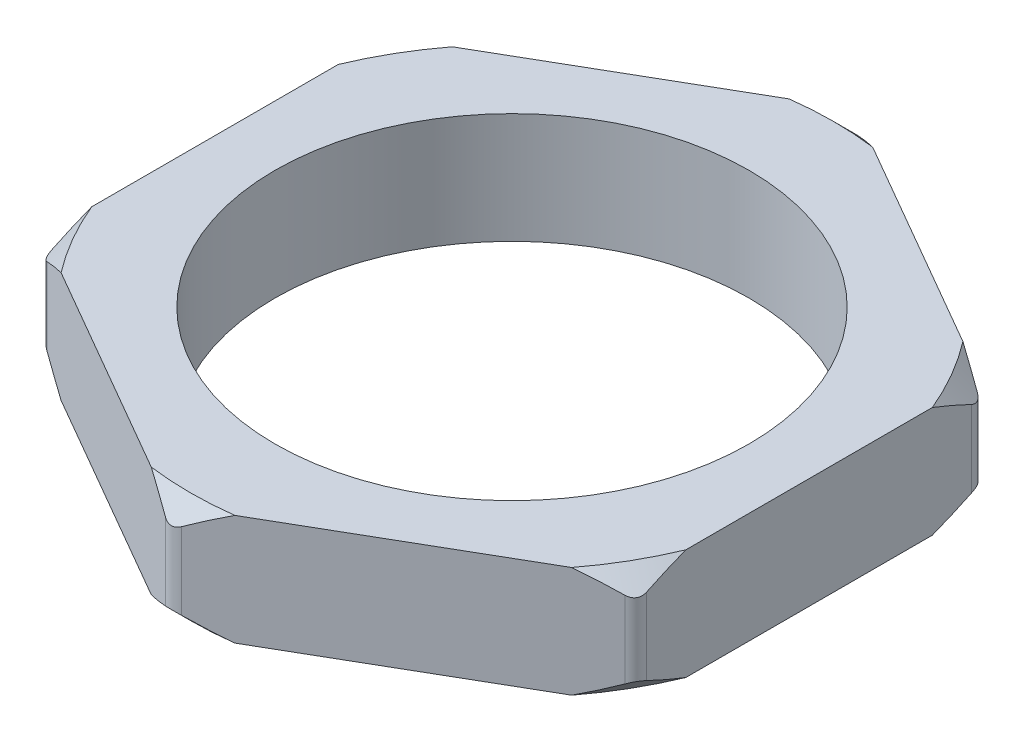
from build123d import *

# Parameters (mm, degrees)
SKETCH1_R      = 9.525
EXTRUDE1_DEPTH = 4.445
FILLET1_R      = 0.635


with BuildPart() as part:
    # Sketch1 → Extrude1 (new body)
    with BuildSketch(Plane(origin=(0, 0, 0), x_dir=(1, 0, 0), z_dir=(0, 1, 0))):
        Polygon((-11.938, 6.892407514), (-11.938, -6.892407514), (0, -13.784815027), (11.938, -6.892407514), (11.938, 6.892407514), (0, 13.784815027), align=None)
        with Locations(Location((0, 0, 0), (0, 0, 270))):
            Circle(SKETCH1_R, mode=Mode.SUBTRACT)
    extrude(amount=EXTRUDE1_DEPTH)

    # Fillet1
    fillet1_edges = [part.edges().sort_by_distance(p)[0] for p in [
        (11.938, 2.2225, 6.892407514),
        (0, 2.2225, 13.784815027),
        (-11.938, 2.2225, 6.892407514),
        (-11.938, 2.2225, -6.892407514),
        (0, 2.2225, -13.784815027),
        (11.938, 2.2225, -6.892407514),
    ]]
    fillet(fillet1_edges, radius=FILLET1_R)

    # Sketch2 → Cut-Revolve2 (revolve, cut)
    with BuildSketch(Plane.ZY):
        Polygon((13.686580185, 3.683), (12.924580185, 4.445), (13.686580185, 4.445), align=None)
        Polygon((13.686580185, 0), (12.924580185, 0), (13.686580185, 0.762), align=None)
    revolve(axis=Axis((0, 4.445, 0), (0, -1, 0)), mode=Mode.SUBTRACT)


solid = part.part
